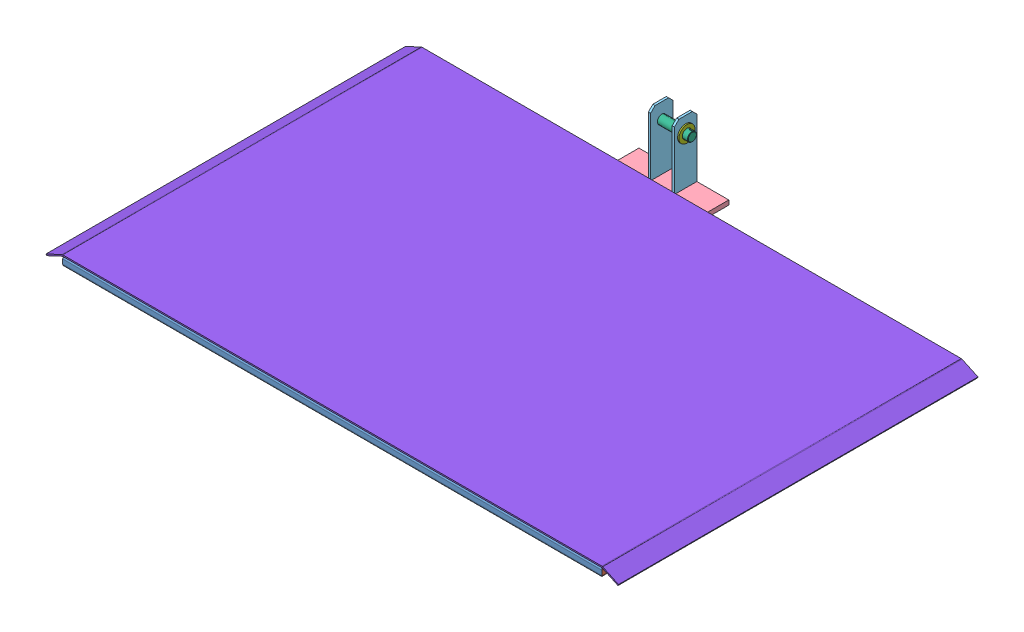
SolidWorks assembly Cadre plateau.SLDASM, configuration Défaut (file format 3100). Lengths in mm.
Overall size (1275.13 977.93 850).
11 component instances, 8 part files, 28 mates.
Components (placement in the parent):
- tube lg 1200-1: tube lg 1200.SLDPRT [Défaut] at (-615.47 272.7879 0) size (1200 20 35)
- Tube LG 1000-1: Tube LG 1000.SLDPRT [Défaut] at (567.03 272.7879 782.5) x (0 0 -1) z (1 0 0) size (800 20 35)
- Tube LG 1000-2: Tube LG 1000.SLDPRT [Défaut] at (-597.97 272.7879 -17.5) x (0 0 1) z (-1 0 0) size (800 20 35)
- tube lg 1200-2: tube lg 1200.SLDPRT [Défaut] at (-615.47 272.7879 765) x (1 0 0) z (0 0 -1) size (1200 20 35)
- Tube LG 960-2: Tube LG 960.SLDPRT [Défaut] at (-32.97 272.7879 747.5) x (0 0 -1) z (1 0 0) size (730 20 35)
- PLAQUE PLATEAU-1: PLAQUE PLATEAU.SLDPRT [Défaut] at (-182.97 282.7879 -67.5) x (1 0 0) z (0 -1 0) size (200 50 10)
- CHAPE PLATEAU-1: CHAPE PLATEAU.SLDPRT [Défaut] at (-111.97 282.7879 -17.5) x (0 0 -1) z (1 0 0) size (50 140 5)
- CHAPE PLATEAU-2: CHAPE PLATEAU.SLDPRT [Défaut] at (-53.97 282.7879 -67.5) x (0 0 1) z (-1 0 0) size (50 140 5)
- Axe plate forme-1: Axe plate forme.SLDPRT [Défaut] at (-119.97 388.7879 -42.5) x (1 0 0) z (0 0.289778 0.957094) size (81 36 36)
- Rondelle plate forme-1: Rondelle plate forme.SLDPRT [Défaut] at (-53.97 388.7879 -42.5) x (0 -0.289778 -0.957094) z (1 0 0) size (36 36 3)
- Plate forme-2: Plate forme.SLDPRT [Défaut] at (-652.6271 268.8845 -17.5) x (0.906308 0.422618 0) z (0.422618 -0.906308 0) size (1154.92 800 540.48)
Mates (geometry in assembly coordinates):
- Coïncidente2: coincident aligned: plane of tube lg 1200-1 through (584.53 282.7879 12.5) normal (0 1 0); plane of Tube LG 1000-1 through (579.53 282.7879 -17.5) normal (0 1 0)
- Coïncidente4: coincident anti-aligned: plane of tube lg 1200-1 through (584.53 262.7879 -17.5) normal (0.707107 0 0.707107); plane of Tube LG 1000-1 through (584.53 262.7879 -17.5) normal (-0.707107 0 -0.707107)
- Coïncidente5: coincident anti-aligned: line of tube lg 1200-1; line of Tube LG 1000-1
- Coïncidente6: coincident aligned: plane of tube lg 1200-1 through (584.53 282.7879 12.5) normal (0 1 0); plane of Tube LG 1000-2 through (-610.47 282.7879 782.5) normal (0 1 0)
- Coïncidente7: coincident anti-aligned: plane of tube lg 1200-1 through (-615.47 262.7879 -17.5) normal (-0.707107 0 0.707107); plane of Tube LG 1000-2 through (-615.47 262.7879 -17.5) normal (0.707107 0 -0.707107)
- Coïncidente8: coincident anti-aligned: line of tube lg 1200-1; line of Tube LG 1000-2
- Coïncidente9: coincident aligned: plane of Tube LG 1000-1 through (579.53 282.7879 -17.5) normal (0 1 0); plane of tube lg 1200-2 through (584.53 282.7879 752.5) normal (0 1 0)
- Coïncidente10: coincident anti-aligned: plane of Tube LG 1000-2 through (-615.47 262.7879 782.5) normal (0.707107 0 0.707107); plane of tube lg 1200-2 through (-615.47 282.7879 782.5) normal (-0.707107 0 -0.707107)
- Coïncidente11: coincident aligned: line of Tube LG 1000-2; line of tube lg 1200-2
- Coïncidente12: coincident aligned: plane of tube lg 1200-1 through (584.53 282.7879 12.5) normal (0 1 0); plane of Tube LG 960-2 through (-20.47 282.7879 17.5) normal (0 1 0)
- Coïncidente13: coincident anti-aligned: plane of Tube LG 960-2 through (-45.47 277.7879 17.5) normal (0 0 -1); plane of tube lg 1200-1 through (584.53 277.7879 17.5) normal (0 0 1)
- Distance1: distance = 530 mm anti-aligned: plane of Tube LG 1000-2 through (-580.47 277.7879 782.5) normal (1 0 0); plane of Tube LG 960-2 through (-50.47 277.7879 17.5) normal (-1 0 0)
- Coïncidente15: coincident anti-aligned: plane of tube lg 1200-1 through (584.53 277.7879 -17.5) normal (0 0 -1); plane of PLAQUE PLATEAU-1 through (-182.97 272.7879 -17.5) normal (0 0 1)
- Coïncidente16: coincident aligned: plane of tube lg 1200-1 through (584.53 282.7879 12.5) normal (0 1 0); plane of PLAQUE PLATEAU-1 through (-182.97 282.7879 -17.5) normal (0 1 0)
- Distance3: distance = 32.5 mm aligned: plane of Tube LG 960-2 through (-15.47 277.7879 17.5) normal (1 0 0); plane of PLAQUE PLATEAU-1 through (17.03 272.7879 -67.5) normal (1 0 0)
- Coïncidente19: coincident anti-aligned: plane of PLAQUE PLATEAU-1 through (-182.97 282.7879 -17.5) normal (0 1 0); plane of CHAPE PLATEAU-1 through (-106.97 282.7879 -17.5) normal (0 -1 0)
- Distance4: distance = 71 mm aligned: plane of PLAQUE PLATEAU-1 through (-182.97 272.7879 -67.5) normal (-1 0 0); plane of CHAPE PLATEAU-1 through (-111.97 422.7879 -17.5) normal (-1 0 0)
- Coïncidente21: coincident: plane of PLAQUE PLATEAU-1 through (-182.97 272.7879 -67.5) normal (0 0 -1); line of CHAPE PLATEAU-1
- Coïncidente22: coincident anti-aligned: plane of PLAQUE PLATEAU-1 through (-182.97 282.7879 -17.5) normal (0 1 0); plane of CHAPE PLATEAU-2 through (-58.97 282.7879 -67.5) normal (0 -1 0)
- Coaxiale1: concentric anti-aligned: cylinder of CHAPE PLATEAU-1; cylinder of CHAPE PLATEAU-2
- Distance5: distance = 71 mm aligned: plane of PLAQUE PLATEAU-1 through (17.03 272.7879 -67.5) normal (1 0 0); plane of CHAPE PLATEAU-2 through (-53.97 422.7879 -67.5) normal (1 0 0)
- Coïncidente26: coincident anti-aligned: plane of CHAPE PLATEAU-1 through (-111.97 422.7879 -17.5) normal (-1 0 0); plane of Axe plate forme-1 through (-111.97 406.0156 -47.716) normal (1 0 0)
- Coïncidente27: coincident anti-aligned: plane of CHAPE PLATEAU-2 through (-53.97 422.7879 -67.5) normal (1 0 0); plane of Rondelle plate forme-1 through (-53.97 388.7879 -42.5) normal (-1 0 0)
- Coaxiale2: concentric anti-aligned: cylinder of CHAPE PLATEAU-2; cylinder of Rondelle plate forme-1
- Coaxiale3: concentric aligned: cylinder of Axe plate forme-1; cylinder of Rondelle plate forme-1
- Coïncidente29: coincident anti-aligned: plane of Tube LG 1000-1 through (579.53 282.7879 -17.5) normal (0 1 0); plane of Plate forme-2 through (-651.3346 282.7879 782.5) normal (0 -1 0)
- Coïncidente32: coincident aligned: plane of tube lg 1200-1 through (584.53 277.7879 -17.5) normal (0 0 -1); plane of Plate forme-2 through (-651.3346 282.7879 -17.5) normal (0 0 -1)
- Distance7: distance = 37.16 mm: plane of Tube LG 1000-1; point of Plate forme-2
